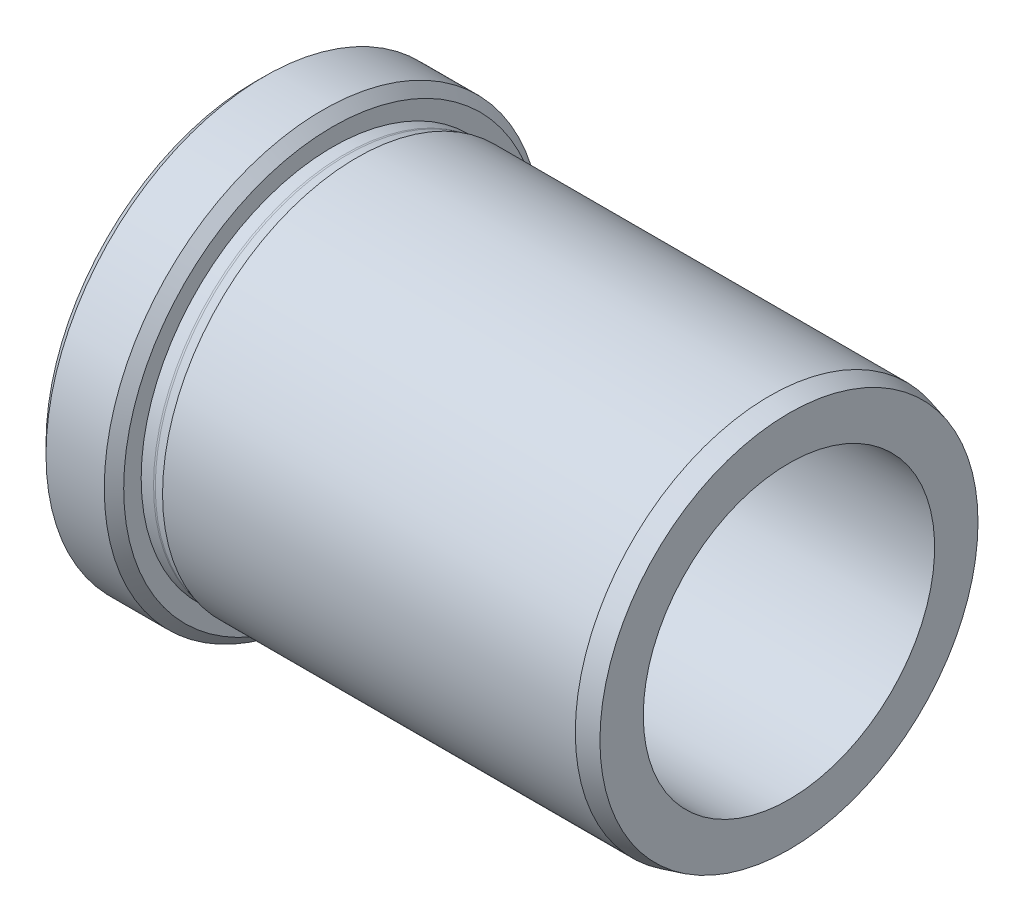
ISO-10303-21;
HEADER;
FILE_DESCRIPTION(('STEP AP214'),'2;1');
FILE_NAME('part.step','',(''),(''),'','','');
FILE_SCHEMA(('AUTOMOTIVE_DESIGN { 1 0 10303 214 1 1 1 1 }'));
ENDSEC;
DATA;
#1=APPLICATION_CONTEXT('core data for automotive mechanical design processes');
#2=APPLICATION_PROTOCOL_DEFINITION('international standard','automotive_design',2000,#1);
#3=PRODUCT_CONTEXT('',#1,'mechanical');
#4=PRODUCT('Part','Part','',(#3));
#5=PRODUCT_RELATED_PRODUCT_CATEGORY('part','',(#4));
#6=PRODUCT_DEFINITION_FORMATION('','',#4);
#7=PRODUCT_DEFINITION_CONTEXT('part definition',#1,'design');
#8=PRODUCT_DEFINITION('design','',#6,#7);
#9=PRODUCT_DEFINITION_SHAPE('','',#8);
#10=(LENGTH_UNIT() NAMED_UNIT(*) SI_UNIT(.MILLI.,.METRE.));
#11=(NAMED_UNIT(*) PLANE_ANGLE_UNIT() SI_UNIT($,.RADIAN.));
#12=(NAMED_UNIT(*) SI_UNIT($,.STERADIAN.) SOLID_ANGLE_UNIT());
#13=UNCERTAINTY_MEASURE_WITH_UNIT(LENGTH_MEASURE(1.E-05),#10,'distance_accuracy_value','');
#14=(GEOMETRIC_REPRESENTATION_CONTEXT(3) GLOBAL_UNCERTAINTY_ASSIGNED_CONTEXT((#13)) GLOBAL_UNIT_ASSIGNED_CONTEXT((#10,
#11,#12)) REPRESENTATION_CONTEXT('',''));
#15=CARTESIAN_POINT('',(0.,0.,0.));
#16=DIRECTION('',(0.,0.,1.));
#17=DIRECTION('',(1.,0.,0.));
#18=AXIS2_PLACEMENT_3D('',#15,#16,#17);
#19=CARTESIAN_POINT('',(20.075539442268,0.,0.));
#20=DIRECTION('',(-1.,0.,0.));
#21=DIRECTION('',(0.,0.,1.));
#22=AXIS2_PLACEMENT_3D('',#19,#20,#21);
#23=TOROIDAL_SURFACE('',#22,20.5,0.8);
#24=CARTESIAN_POINT('',(20.075539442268,0.,0.));
#25=DIRECTION('',(-1.,0.,0.));
#26=DIRECTION('',(0.,0.,1.));
#27=AXIS2_PLACEMENT_3D('',#24,#25,#26);
#28=CIRCLE('',#27,19.7);
#29=CARTESIAN_POINT('',(20.075539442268,0.,19.7));
#30=VERTEX_POINT('',#29);
#31=EDGE_CURVE('E58',#30,#30,#28,.T.);
#32=ORIENTED_EDGE('',*,*,#31,.F.);
#33=EDGE_LOOP('',(#32));
#34=FACE_BOUND('',#33,.T.);
#35=CARTESIAN_POINT('',(20.28259467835,0.,0.));
#36=DIRECTION('',(-1.,0.,0.));
#37=DIRECTION('',(0.,0.,1.));
#38=AXIS2_PLACEMENT_3D('',#35,#36,#37);
#39=CIRCLE('',#38,19.7272593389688);
#40=CARTESIAN_POINT('',(20.28259467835,0.,19.7272593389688));
#41=VERTEX_POINT('',#40);
#42=EDGE_CURVE('E40',#41,#41,#39,.T.);
#43=ORIENTED_EDGE('',*,*,#42,.T.);
#44=EDGE_LOOP('',(#43));
#45=FACE_BOUND('',#44,.T.);
#46=ADVANCED_FACE('F14',(#34,#45),#23,.F.);
#47=CARTESIAN_POINT('',(21.3004766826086,0.,0.));
#48=DIRECTION('',(1.,0.,0.));
#49=DIRECTION('',(0.,0.,-1.));
#50=AXIS2_PLACEMENT_3D('',#47,#48,#49);
#51=CONICAL_SURFACE('',#50,20.,0.261799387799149);
#52=ORIENTED_EDGE('',*,*,#42,.F.);
#53=EDGE_LOOP('',(#52));
#54=FACE_BOUND('',#53,.T.);
#55=CARTESIAN_POINT('',(21.3004766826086,0.,0.));
#56=DIRECTION('',(-1.,0.,0.));
#57=DIRECTION('',(0.,0.,1.));
#58=AXIS2_PLACEMENT_3D('',#55,#56,#57);
#59=CIRCLE('',#58,20.);
#60=CARTESIAN_POINT('',(21.3004766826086,0.,20.));
#61=VERTEX_POINT('',#60);
#62=EDGE_CURVE('E43',#61,#61,#59,.T.);
#63=ORIENTED_EDGE('',*,*,#62,.T.);
#64=EDGE_LOOP('',(#63));
#65=FACE_BOUND('',#64,.T.);
#66=ADVANCED_FACE('F66',(#54,#65),#51,.T.);
#67=CARTESIAN_POINT('',(0.,0.,0.));
#68=DIRECTION('',(-1.,0.,0.));
#69=DIRECTION('',(0.,0.,1.));
#70=AXIS2_PLACEMENT_3D('',#67,#68,#69);
#71=CYLINDRICAL_SURFACE('',#70,20.);
#72=ORIENTED_EDGE('',*,*,#62,.F.);
#73=EDGE_LOOP('',(#72));
#74=FACE_BOUND('',#73,.T.);
#75=CARTESIAN_POINT('',(63.8004766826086,0.,0.));
#76=DIRECTION('',(-1.,0.,0.));
#77=DIRECTION('',(0.,0.,1.));
#78=AXIS2_PLACEMENT_3D('',#75,#76,#77);
#79=CIRCLE('',#78,20.);
#80=CARTESIAN_POINT('',(63.8004766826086,0.,20.));
#81=VERTEX_POINT('',#80);
#82=EDGE_CURVE('E46',#81,#81,#79,.T.);
#83=ORIENTED_EDGE('',*,*,#82,.T.);
#84=EDGE_LOOP('',(#83));
#85=FACE_BOUND('',#84,.T.);
#86=ADVANCED_FACE('F72',(#74,#85),#71,.T.);
#87=CARTESIAN_POINT('',(65.8004766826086,0.,0.));
#88=DIRECTION('',(-1.,0.,0.));
#89=DIRECTION('',(0.,0.,1.));
#90=AXIS2_PLACEMENT_3D('',#87,#88,#89);
#91=CONICAL_SURFACE('',#90,19.4641016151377,0.26179938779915);
#92=ORIENTED_EDGE('',*,*,#82,.F.);
#93=EDGE_LOOP('',(#92));
#94=FACE_BOUND('',#93,.T.);
#95=CARTESIAN_POINT('',(65.8004766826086,0.,0.));
#96=DIRECTION('',(-1.,0.,0.));
#97=DIRECTION('',(0.,0.,1.));
#98=AXIS2_PLACEMENT_3D('',#95,#96,#97);
#99=CIRCLE('',#98,19.4641016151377);
#100=CARTESIAN_POINT('',(65.8004766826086,0.,19.4641016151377));
#101=VERTEX_POINT('',#100);
#102=EDGE_CURVE('E49',#101,#101,#99,.T.);
#103=ORIENTED_EDGE('',*,*,#102,.T.);
#104=EDGE_LOOP('',(#103));
#105=FACE_BOUND('',#104,.T.);
#106=ADVANCED_FACE('F78',(#94,#105),#91,.T.);
#107=CARTESIAN_POINT('',(65.8004766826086,19.4641016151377,0.));
#108=DIRECTION('',(-1.,0.,0.));
#109=DIRECTION('',(0.,0.,1.));
#110=AXIS2_PLACEMENT_3D('',#107,#108,#109);
#111=PLANE('',#110);
#112=ORIENTED_EDGE('',*,*,#102,.F.);
#113=EDGE_LOOP('',(#112));
#114=FACE_BOUND('',#113,.T.);
#115=CARTESIAN_POINT('',(65.8004766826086,0.,0.));
#116=DIRECTION('',(-1.,0.,0.));
#117=DIRECTION('',(0.,0.,1.));
#118=AXIS2_PLACEMENT_3D('',#115,#116,#117);
#119=CIRCLE('',#118,15.);
#120=CARTESIAN_POINT('',(65.8004766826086,0.,15.));
#121=VERTEX_POINT('',#120);
#122=EDGE_CURVE('E52',#121,#121,#119,.T.);
#123=ORIENTED_EDGE('',*,*,#122,.T.);
#124=EDGE_LOOP('',(#123));
#125=FACE_BOUND('',#124,.T.);
#126=ADVANCED_FACE('F84',(#114,#125),#111,.F.);
#127=CARTESIAN_POINT('',(0.,0.,0.));
#128=DIRECTION('',(-1.,0.,0.));
#129=DIRECTION('',(0.,0.,1.));
#130=AXIS2_PLACEMENT_3D('',#127,#128,#129);
#131=CYLINDRICAL_SURFACE('',#130,15.);
#132=CARTESIAN_POINT('',(12.3004766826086,0.,0.));
#133=DIRECTION('',(1.,0.,0.));
#134=DIRECTION('',(0.,0.,-1.));
#135=AXIS2_PLACEMENT_3D('',#132,#133,#134);
#136=CIRCLE('',#135,15.);
#137=CARTESIAN_POINT('',(12.3004766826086,0.,-15.));
#138=VERTEX_POINT('',#137);
#139=EDGE_CURVE('E29',#138,#138,#136,.F.);
#140=ORIENTED_EDGE('',*,*,#139,.T.);
#141=EDGE_LOOP('',(#140));
#142=FACE_BOUND('',#141,.T.);
#143=ORIENTED_EDGE('',*,*,#122,.F.);
#144=EDGE_LOOP('',(#143));
#145=FACE_BOUND('',#144,.T.);
#146=ADVANCED_FACE('F90',(#142,#145),#131,.F.);
#147=CARTESIAN_POINT('',(10.8004766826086,22.5,0.));
#148=DIRECTION('',(1.,0.,0.));
#149=DIRECTION('',(0.,0.,-1.));
#150=AXIS2_PLACEMENT_3D('',#147,#148,#149);
#151=PLANE('',#150);
#152=CARTESIAN_POINT('',(10.8004766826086,0.,0.));
#153=DIRECTION('',(1.,0.,0.));
#154=DIRECTION('',(0.,0.,-1.));
#155=AXIS2_PLACEMENT_3D('',#152,#153,#154);
#156=CIRCLE('',#155,16.5);
#157=CARTESIAN_POINT('',(10.8004766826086,0.,-16.5));
#158=VERTEX_POINT('',#157);
#159=EDGE_CURVE('E25',#158,#158,#156,.T.);
#160=ORIENTED_EDGE('',*,*,#159,.T.);
#161=EDGE_LOOP('',(#160));
#162=FACE_BOUND('',#161,.T.);
#163=CARTESIAN_POINT('',(10.8004766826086,0.,0.));
#164=DIRECTION('',(1.,0.,0.));
#165=DIRECTION('',(0.,0.,-1.));
#166=AXIS2_PLACEMENT_3D('',#163,#164,#165);
#167=CIRCLE('',#166,21.5);
#168=CARTESIAN_POINT('',(10.8004766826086,0.,-21.5));
#169=VERTEX_POINT('',#168);
#170=EDGE_CURVE('E37',#169,#169,#167,.F.);
#171=ORIENTED_EDGE('',*,*,#170,.T.);
#172=EDGE_LOOP('',(#171));
#173=FACE_BOUND('',#172,.T.);
#174=ADVANCED_FACE('F95',(#162,#173),#151,.F.);
#175=CARTESIAN_POINT('',(0.,0.,0.));
#176=DIRECTION('',(-1.,0.,0.));
#177=DIRECTION('',(0.,0.,1.));
#178=AXIS2_PLACEMENT_3D('',#175,#176,#177);
#179=CYLINDRICAL_SURFACE('',#178,22.5);
#180=CARTESIAN_POINT('',(17.8004766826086,0.,0.));
#181=DIRECTION('',(-1.,0.,0.));
#182=DIRECTION('',(0.,0.,1.));
#183=AXIS2_PLACEMENT_3D('',#180,#181,#182);
#184=CIRCLE('',#183,22.5);
#185=CARTESIAN_POINT('',(17.8004766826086,0.,22.5));
#186=VERTEX_POINT('',#185);
#187=EDGE_CURVE('E21',#186,#186,#184,.T.);
#188=ORIENTED_EDGE('',*,*,#187,.T.);
#189=EDGE_LOOP('',(#188));
#190=FACE_BOUND('',#189,.T.);
#191=CARTESIAN_POINT('',(11.8004766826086,0.,0.));
#192=DIRECTION('',(1.,0.,0.));
#193=DIRECTION('',(0.,0.,-1.));
#194=AXIS2_PLACEMENT_3D('',#191,#192,#193);
#195=CIRCLE('',#194,22.5);
#196=CARTESIAN_POINT('',(11.8004766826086,0.,-22.5));
#197=VERTEX_POINT('',#196);
#198=EDGE_CURVE('E34',#197,#197,#195,.T.);
#199=ORIENTED_EDGE('',*,*,#198,.T.);
#200=EDGE_LOOP('',(#199));
#201=FACE_BOUND('',#200,.T.);
#202=ADVANCED_FACE('F103',(#190,#201),#179,.T.);
#203=CARTESIAN_POINT('',(18.8004766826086,22.5,0.));
#204=DIRECTION('',(-1.,0.,0.));
#205=DIRECTION('',(0.,0.,1.));
#206=AXIS2_PLACEMENT_3D('',#203,#204,#205);
#207=PLANE('',#206);
#208=CARTESIAN_POINT('',(18.8004766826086,0.,0.));
#209=DIRECTION('',(-1.,0.,0.));
#210=DIRECTION('',(0.,0.,1.));
#211=AXIS2_PLACEMENT_3D('',#208,#209,#210);
#212=CIRCLE('',#211,21.5);
#213=CARTESIAN_POINT('',(18.8004766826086,0.,21.5));
#214=VERTEX_POINT('',#213);
#215=EDGE_CURVE('E9',#214,#214,#212,.F.);
#216=ORIENTED_EDGE('',*,*,#215,.T.);
#217=EDGE_LOOP('',(#216));
#218=FACE_BOUND('',#217,.T.);
#219=CARTESIAN_POINT('',(18.8004766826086,0.,0.));
#220=DIRECTION('',(-1.,0.,0.));
#221=DIRECTION('',(0.,0.,1.));
#222=AXIS2_PLACEMENT_3D('',#219,#220,#221);
#223=CIRCLE('',#222,19.7);
#224=CARTESIAN_POINT('',(18.8004766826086,0.,19.7));
#225=VERTEX_POINT('',#224);
#226=EDGE_CURVE('E55',#225,#225,#223,.T.);
#227=ORIENTED_EDGE('',*,*,#226,.T.);
#228=EDGE_LOOP('',(#227));
#229=FACE_BOUND('',#228,.T.);
#230=ADVANCED_FACE('F142',(#218,#229),#207,.F.);
#231=CARTESIAN_POINT('',(0.,0.,0.));
#232=DIRECTION('',(-1.,0.,0.));
#233=DIRECTION('',(0.,0.,1.));
#234=AXIS2_PLACEMENT_3D('',#231,#232,#233);
#235=CYLINDRICAL_SURFACE('',#234,19.7);
#236=ORIENTED_EDGE('',*,*,#226,.F.);
#237=EDGE_LOOP('',(#236));
#238=FACE_BOUND('',#237,.T.);
#239=ORIENTED_EDGE('',*,*,#31,.T.);
#240=EDGE_LOOP('',(#239));
#241=FACE_BOUND('',#240,.T.);
#242=ADVANCED_FACE('F62',(#238,#241),#235,.T.);
#243=CARTESIAN_POINT('',(10.8004766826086,0.,0.));
#244=DIRECTION('',(1.,0.,0.));
#245=DIRECTION('',(0.,0.,-1.));
#246=AXIS2_PLACEMENT_3D('',#243,#244,#245);
#247=CONICAL_SURFACE('',#246,21.5,0.785398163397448);
#248=ORIENTED_EDGE('',*,*,#198,.F.);
#249=EDGE_LOOP('',(#248));
#250=FACE_BOUND('',#249,.T.);
#251=ORIENTED_EDGE('',*,*,#170,.F.);
#252=EDGE_LOOP('',(#251));
#253=FACE_BOUND('',#252,.T.);
#254=ADVANCED_FACE('F108',(#250,#253),#247,.T.);
#255=CARTESIAN_POINT('',(12.3004766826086,0.,0.));
#256=DIRECTION('',(1.,0.,0.));
#257=DIRECTION('',(0.,0.,-1.));
#258=AXIS2_PLACEMENT_3D('',#255,#256,#257);
#259=TOROIDAL_SURFACE('',#258,16.5,1.5);
#260=ORIENTED_EDGE('',*,*,#159,.F.);
#261=EDGE_LOOP('',(#260));
#262=FACE_BOUND('',#261,.T.);
#263=ORIENTED_EDGE('',*,*,#139,.F.);
#264=EDGE_LOOP('',(#263));
#265=FACE_BOUND('',#264,.T.);
#266=ADVANCED_FACE('F110',(#262,#265),#259,.T.);
#267=CARTESIAN_POINT('',(17.8004766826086,0.,0.));
#268=DIRECTION('',(-1.,0.,0.));
#269=DIRECTION('',(0.,0.,1.));
#270=AXIS2_PLACEMENT_3D('',#267,#268,#269);
#271=CONICAL_SURFACE('',#270,22.5,0.78539816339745);
#272=ORIENTED_EDGE('',*,*,#215,.F.);
#273=EDGE_LOOP('',(#272));
#274=FACE_BOUND('',#273,.T.);
#275=ORIENTED_EDGE('',*,*,#187,.F.);
#276=EDGE_LOOP('',(#275));
#277=FACE_BOUND('',#276,.T.);
#278=ADVANCED_FACE('F16',(#274,#277),#271,.T.);
#279=CLOSED_SHELL('',(#46,#66,#86,#106,#126,#146,#174,#202,#230,#242,#254,#266,#278));
#280=MANIFOLD_SOLID_BREP('B1',#279);
#281=ADVANCED_BREP_SHAPE_REPRESENTATION('',(#18,#280),#14);
#282=SHAPE_DEFINITION_REPRESENTATION(#9,#281);
ENDSEC;
END-ISO-10303-21;
